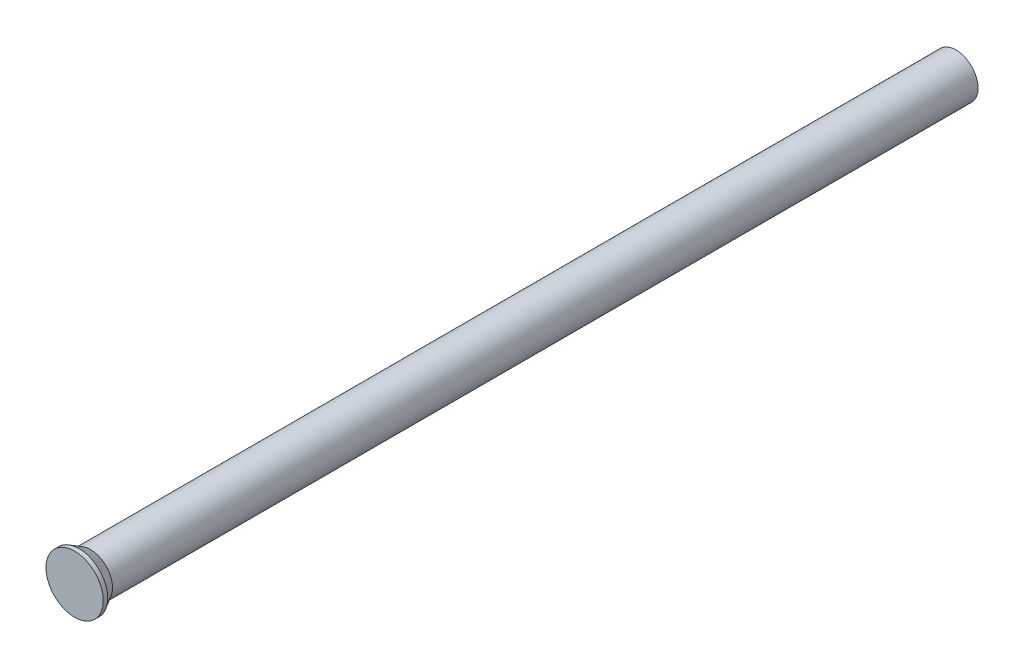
ISO-10303-21;
HEADER;
FILE_DESCRIPTION(('STEP AP214'),'2;1');
FILE_NAME('part.step','',(''),(''),'','','');
FILE_SCHEMA(('AUTOMOTIVE_DESIGN { 1 0 10303 214 1 1 1 1 }'));
ENDSEC;
DATA;
#1=APPLICATION_CONTEXT('core data for automotive mechanical design processes');
#2=APPLICATION_PROTOCOL_DEFINITION('international standard','automotive_design',2000,#1);
#3=PRODUCT_CONTEXT('',#1,'mechanical');
#4=PRODUCT('Part','Part','',(#3));
#5=PRODUCT_RELATED_PRODUCT_CATEGORY('part','',(#4));
#6=PRODUCT_DEFINITION_FORMATION('','',#4);
#7=PRODUCT_DEFINITION_CONTEXT('part definition',#1,'design');
#8=PRODUCT_DEFINITION('design','',#6,#7);
#9=PRODUCT_DEFINITION_SHAPE('','',#8);
#10=(LENGTH_UNIT() NAMED_UNIT(*) SI_UNIT(.MILLI.,.METRE.));
#11=(NAMED_UNIT(*) PLANE_ANGLE_UNIT() SI_UNIT($,.RADIAN.));
#12=(NAMED_UNIT(*) SI_UNIT($,.STERADIAN.) SOLID_ANGLE_UNIT());
#13=UNCERTAINTY_MEASURE_WITH_UNIT(LENGTH_MEASURE(1.E-05),#10,'distance_accuracy_value','');
#14=(GEOMETRIC_REPRESENTATION_CONTEXT(3) GLOBAL_UNCERTAINTY_ASSIGNED_CONTEXT((#13)) GLOBAL_UNIT_ASSIGNED_CONTEXT((#10,
#11,#12)) REPRESENTATION_CONTEXT('',''));
#15=CARTESIAN_POINT('',(0.,0.,0.));
#16=DIRECTION('',(0.,0.,1.));
#17=DIRECTION('',(1.,0.,0.));
#18=AXIS2_PLACEMENT_3D('',#15,#16,#17);
#19=CARTESIAN_POINT('',(0.,0.,0.));
#20=DIRECTION('',(0.,0.,1.));
#21=DIRECTION('',(1.,0.,0.));
#22=AXIS2_PLACEMENT_3D('',#19,#20,#21);
#23=PLANE('',#22);
#24=CARTESIAN_POINT('',(0.,0.,0.));
#25=DIRECTION('',(0.,0.,-1.));
#26=DIRECTION('',(-1.,0.,0.));
#27=AXIS2_PLACEMENT_3D('',#24,#25,#26);
#28=CIRCLE('',#27,3.25);
#29=CARTESIAN_POINT('',(-3.25000000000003,0.,0.));
#30=VERTEX_POINT('',#29);
#31=EDGE_CURVE('E10',#30,#30,#28,.T.);
#32=ORIENTED_EDGE('',*,*,#31,.F.);
#33=EDGE_LOOP('',(#32));
#34=FACE_BOUND('',#33,.T.);
#35=ADVANCED_FACE('F32',(#34),#23,.T.);
#36=CARTESIAN_POINT('',(0.,0.,0.));
#37=DIRECTION('',(0.,0.,-1.));
#38=DIRECTION('',(-1.,0.,0.));
#39=AXIS2_PLACEMENT_3D('',#36,#37,#38);
#40=CYLINDRICAL_SURFACE('',#39,3.25);
#41=ORIENTED_EDGE('',*,*,#31,.T.);
#42=EDGE_LOOP('',(#41));
#43=FACE_BOUND('',#42,.T.);
#44=CARTESIAN_POINT('',(0.,0.,-0.500961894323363));
#45=DIRECTION('',(0.,0.,-1.));
#46=DIRECTION('',(-1.,0.,0.));
#47=AXIS2_PLACEMENT_3D('',#44,#45,#46);
#48=CIRCLE('',#47,3.25);
#49=CARTESIAN_POINT('',(-3.25000000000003,0.,-0.500961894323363));
#50=VERTEX_POINT('',#49);
#51=EDGE_CURVE('E38',#50,#50,#48,.T.);
#52=ORIENTED_EDGE('',*,*,#51,.F.);
#53=EDGE_LOOP('',(#52));
#54=FACE_BOUND('',#53,.T.);
#55=ADVANCED_FACE('F64',(#43,#54),#40,.T.);
#56=CARTESIAN_POINT('',(0.,0.,-1.8));
#57=DIRECTION('',(0.,0.,1.));
#58=DIRECTION('',(1.,0.,0.));
#59=AXIS2_PLACEMENT_3D('',#56,#57,#58);
#60=CONICAL_SURFACE('',#59,2.50000000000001,0.523598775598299);
#61=ORIENTED_EDGE('',*,*,#51,.T.);
#62=EDGE_LOOP('',(#61));
#63=FACE_BOUND('',#62,.T.);
#64=CARTESIAN_POINT('',(0.,0.,-1.8));
#65=DIRECTION('',(0.,0.,-1.));
#66=DIRECTION('',(-1.,0.,0.));
#67=AXIS2_PLACEMENT_3D('',#64,#65,#66);
#68=CIRCLE('',#67,2.50000000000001);
#69=CARTESIAN_POINT('',(-2.50000000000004,0.,-1.8));
#70=VERTEX_POINT('',#69);
#71=EDGE_CURVE('E42',#70,#70,#68,.T.);
#72=ORIENTED_EDGE('',*,*,#71,.F.);
#73=EDGE_LOOP('',(#72));
#74=FACE_BOUND('',#73,.T.);
#75=ADVANCED_FACE('F56',(#63,#74),#60,.T.);
#76=CARTESIAN_POINT('',(0.,0.,0.));
#77=DIRECTION('',(0.,0.,-1.));
#78=DIRECTION('',(-1.,0.,0.));
#79=AXIS2_PLACEMENT_3D('',#76,#77,#78);
#80=CYLINDRICAL_SURFACE('',#79,2.50000000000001);
#81=ORIENTED_EDGE('',*,*,#71,.T.);
#82=EDGE_LOOP('',(#81));
#83=FACE_BOUND('',#82,.T.);
#84=CARTESIAN_POINT('',(0.,0.,-100.));
#85=DIRECTION('',(0.,0.,-1.));
#86=DIRECTION('',(-1.,0.,0.));
#87=AXIS2_PLACEMENT_3D('',#84,#85,#86);
#88=CIRCLE('',#87,2.50000000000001);
#89=CARTESIAN_POINT('',(-2.50000000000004,0.,-100.));
#90=VERTEX_POINT('',#89);
#91=EDGE_CURVE('E46',#90,#90,#88,.T.);
#92=ORIENTED_EDGE('',*,*,#91,.F.);
#93=EDGE_LOOP('',(#92));
#94=FACE_BOUND('',#93,.T.);
#95=ADVANCED_FACE('F54',(#83,#94),#80,.T.);
#96=CARTESIAN_POINT('',(0.,2.50000000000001,-100.));
#97=DIRECTION('',(0.,0.,-1.));
#98=DIRECTION('',(-1.,0.,0.));
#99=AXIS2_PLACEMENT_3D('',#96,#97,#98);
#100=PLANE('',#99);
#101=ORIENTED_EDGE('',*,*,#91,.T.);
#102=EDGE_LOOP('',(#101));
#103=FACE_BOUND('',#102,.T.);
#104=ADVANCED_FACE('F52',(#103),#100,.T.);
#105=CLOSED_SHELL('',(#35,#55,#75,#95,#104));
#106=MANIFOLD_SOLID_BREP('B2',#105);
#107=ADVANCED_BREP_SHAPE_REPRESENTATION('',(#18,#106),#14);
#108=SHAPE_DEFINITION_REPRESENTATION(#9,#107);
ENDSEC;
END-ISO-10303-21;
